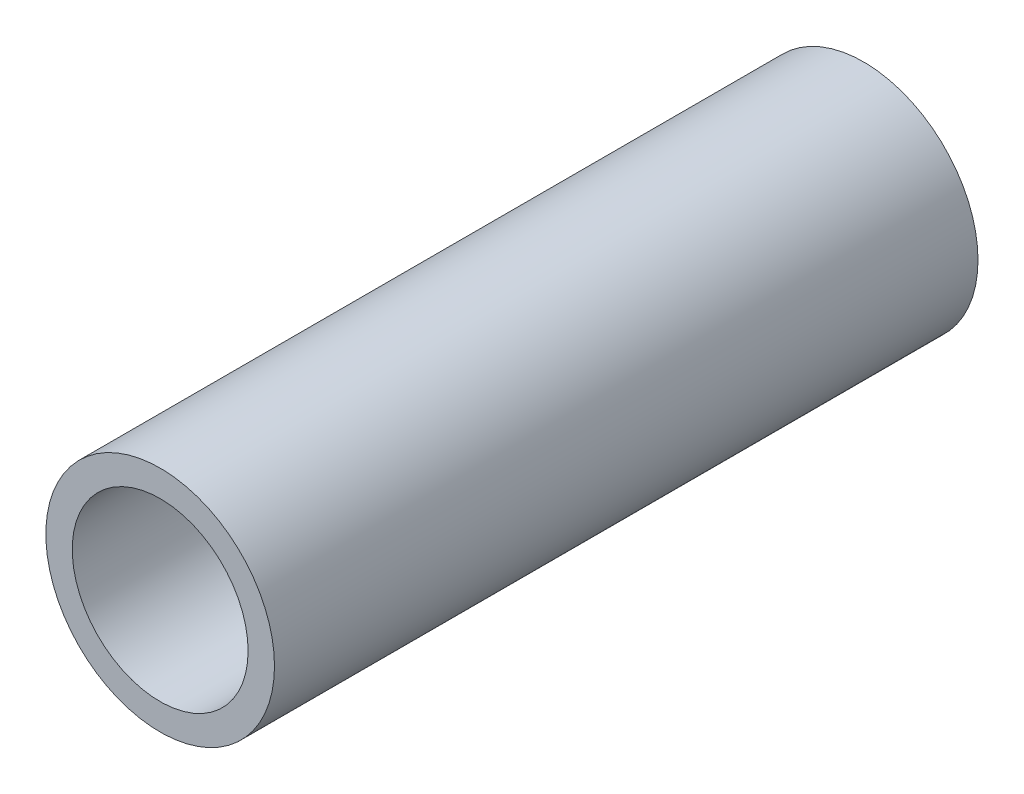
from build123d import *

# Parameters (mm, degrees)
SKETCH1_R          = 8.255
SKETCH1_R_2        = 6.35
BASE_EXTRUDE_DEPTH = 50.8


with BuildPart() as part:
    # Sketch1 → Base-Extrude (new body)
    with BuildSketch(Plane.XY):
        Circle(SKETCH1_R)
        Circle(SKETCH1_R_2, mode=Mode.SUBTRACT)
    extrude(amount=BASE_EXTRUDE_DEPTH)


solid = part.part
